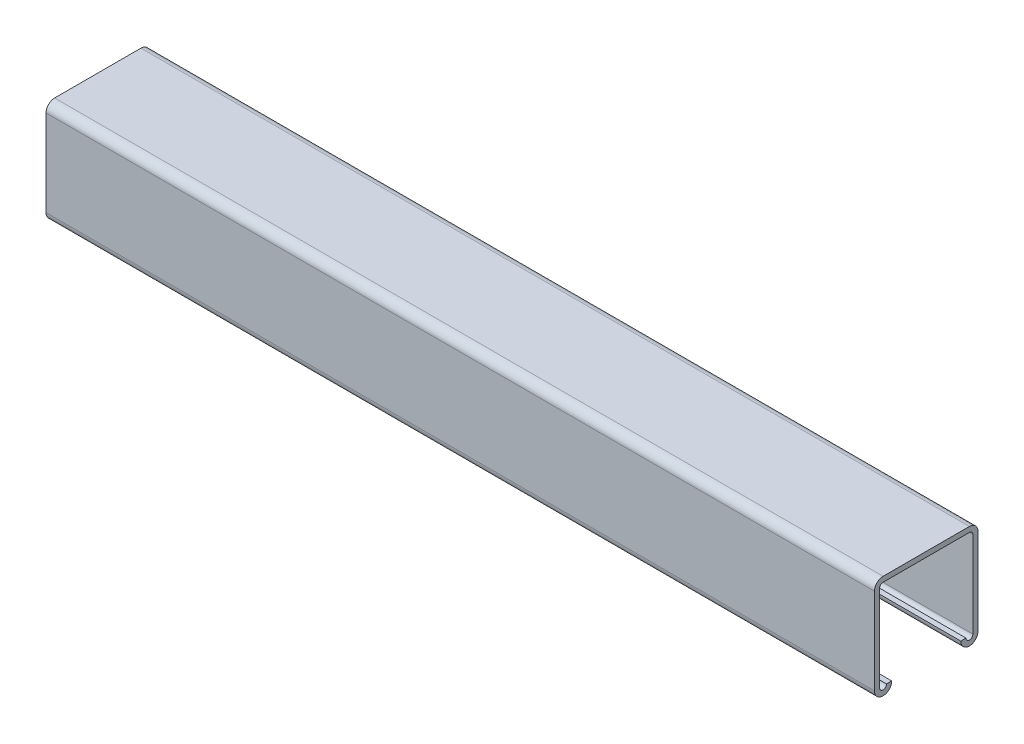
from build123d import *

# Parameters (mm, degrees)
CHANNEL_DEPTH = 304.8


with BuildPart() as part:
    # Sketch1 → Channel (new body)
    with BuildSketch(Plane(origin=(0, 39.243400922, 0), x_dir=(0, 0, 1), z_dir=(1, 0, 0))):
        with BuildLine():
            ThreePointArc((-12.7, 74.168400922), (-15.875, 77.343400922), (-19.05, 74.168400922))
            Line((-19.05, 74.168400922), (-19.05, 42.418400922))
            ThreePointArc((-19.05, 42.418400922), (-18.12006403, 40.173336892), (-15.875, 39.243400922))
            Line((-15.875, 39.243400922), (15.875, 39.243400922))
            ThreePointArc((15.875, 39.243400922), (18.12006403, 40.173336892), (19.05, 42.418400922))
            Line((19.05, 42.418400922), (19.05, 74.168400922))
            ThreePointArc((19.05, 74.168400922), (15.875, 77.343400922), (12.7, 74.168400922))
            Line((12.7, 74.168400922), (14.605, 74.168400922))
            ThreePointArc((14.605, 74.168400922), (15.875, 75.438400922), (17.145, 74.168400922))
            Line((17.145, 74.168400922), (17.145, 42.418400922))
            ThreePointArc((17.145, 42.418400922), (16.773025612, 41.52037531), (15.875, 41.148400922))
            Line((15.875, 41.148400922), (-15.875, 41.148400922))
            ThreePointArc((-15.875, 41.148400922), (-16.773025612, 41.52037531), (-17.145, 42.418400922))
            Line((-17.145, 42.418400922), (-17.145, 74.168400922))
            ThreePointArc((-17.145, 74.168400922), (-15.875, 75.438400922), (-14.605, 74.168400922))
            Line((-14.605, 74.168400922), (-12.7, 74.168400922))
        make_face()
    extrude(amount=CHANNEL_DEPTH)


solid = part.part
